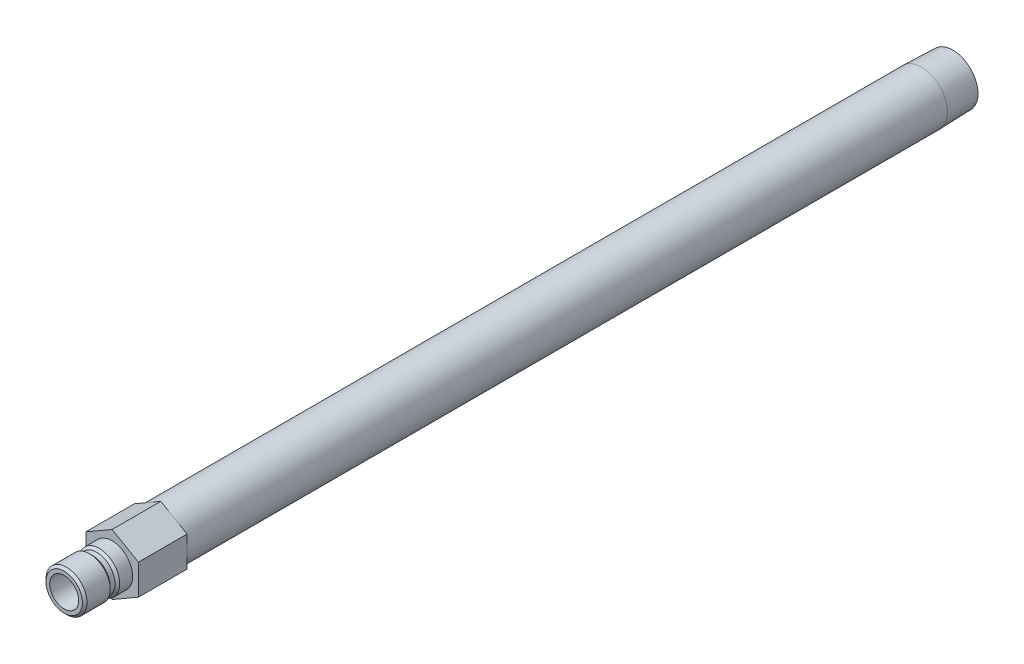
ISO-10303-21;
HEADER;
FILE_DESCRIPTION(('STEP AP214'),'2;1');
FILE_NAME('part.step','',(''),(''),'','','');
FILE_SCHEMA(('AUTOMOTIVE_DESIGN { 1 0 10303 214 1 1 1 1 }'));
ENDSEC;
DATA;
#1=APPLICATION_CONTEXT('core data for automotive mechanical design processes');
#2=APPLICATION_PROTOCOL_DEFINITION('international standard','automotive_design',2000,#1);
#3=PRODUCT_CONTEXT('',#1,'mechanical');
#4=PRODUCT('Part','Part','',(#3));
#5=PRODUCT_RELATED_PRODUCT_CATEGORY('part','',(#4));
#6=PRODUCT_DEFINITION_FORMATION('','',#4);
#7=PRODUCT_DEFINITION_CONTEXT('part definition',#1,'design');
#8=PRODUCT_DEFINITION('design','',#6,#7);
#9=PRODUCT_DEFINITION_SHAPE('','',#8);
#10=(LENGTH_UNIT() NAMED_UNIT(*) SI_UNIT(.MILLI.,.METRE.));
#11=(NAMED_UNIT(*) PLANE_ANGLE_UNIT() SI_UNIT($,.RADIAN.));
#12=(NAMED_UNIT(*) SI_UNIT($,.STERADIAN.) SOLID_ANGLE_UNIT());
#13=UNCERTAINTY_MEASURE_WITH_UNIT(LENGTH_MEASURE(1.E-05),#10,'distance_accuracy_value','');
#14=(GEOMETRIC_REPRESENTATION_CONTEXT(3) GLOBAL_UNCERTAINTY_ASSIGNED_CONTEXT((#13)) GLOBAL_UNIT_ASSIGNED_CONTEXT((#10,
#11,#12)) REPRESENTATION_CONTEXT('',''));
#15=CARTESIAN_POINT('',(0.,0.,0.));
#16=DIRECTION('',(0.,0.,1.));
#17=DIRECTION('',(1.,0.,0.));
#18=AXIS2_PLACEMENT_3D('',#15,#16,#17);
#19=CARTESIAN_POINT('',(0.,0.,0.));
#20=DIRECTION('',(0.,0.,-1.));
#21=DIRECTION('',(0.,1.,0.));
#22=AXIS2_PLACEMENT_3D('',#19,#20,#21);
#23=CYLINDRICAL_SURFACE('',#22,8.57249999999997);
#24=CARTESIAN_POINT('',(0.,0.,-266.0142));
#25=DIRECTION('',(0.,0.,-1.));
#26=DIRECTION('',(0.,1.,0.));
#27=AXIS2_PLACEMENT_3D('',#24,#25,#26);
#28=CIRCLE('',#27,8.57249999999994);
#29=CARTESIAN_POINT('',(0.,8.5725,-266.0142));
#30=VERTEX_POINT('',#29);
#31=EDGE_CURVE('E168',#30,#30,#28,.T.);
#32=ORIENTED_EDGE('',*,*,#31,.F.);
#33=EDGE_LOOP('',(#32));
#34=FACE_BOUND('',#33,.T.);
#35=CARTESIAN_POINT('',(0.,0.,-16.002));
#36=DIRECTION('',(0.,0.,1.));
#37=DIRECTION('',(1.,0.,0.));
#38=AXIS2_PLACEMENT_3D('',#35,#36,#37);
#39=CIRCLE('',#38,8.57249999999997);
#40=CARTESIAN_POINT('',(8.57249999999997,0.,-16.002));
#41=VERTEX_POINT('',#40);
#42=EDGE_CURVE('E37',#41,#41,#39,.F.);
#43=ORIENTED_EDGE('',*,*,#42,.T.);
#44=EDGE_LOOP('',(#43));
#45=FACE_BOUND('',#44,.T.);
#46=ADVANCED_FACE('F33',(#34,#45),#23,.T.);
#47=CARTESIAN_POINT('',(0.,0.,0.));
#48=DIRECTION('',(0.,0.,-1.));
#49=DIRECTION('',(0.,1.,0.));
#50=AXIS2_PLACEMENT_3D('',#47,#48,#49);
#51=CYLINDRICAL_SURFACE('',#50,4.7625);
#52=CARTESIAN_POINT('',(0.,0.,15.748));
#53=DIRECTION('',(0.,0.,-1.));
#54=DIRECTION('',(0.,1.,0.));
#55=AXIS2_PLACEMENT_3D('',#52,#53,#54);
#56=CIRCLE('',#55,4.7625);
#57=CARTESIAN_POINT('',(0.,4.7625,15.748));
#58=VERTEX_POINT('',#57);
#59=EDGE_CURVE('E144',#58,#58,#56,.T.);
#60=ORIENTED_EDGE('',*,*,#59,.F.);
#61=EDGE_LOOP('',(#60));
#62=FACE_BOUND('',#61,.T.);
#63=CARTESIAN_POINT('',(0.,0.,-16.002));
#64=DIRECTION('',(0.,0.,-1.));
#65=DIRECTION('',(0.,1.,0.));
#66=AXIS2_PLACEMENT_3D('',#63,#64,#65);
#67=CIRCLE('',#66,4.76249999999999);
#68=CARTESIAN_POINT('',(0.,4.7625,-16.002));
#69=VERTEX_POINT('',#68);
#70=EDGE_CURVE('E11',#69,#69,#67,.T.);
#71=ORIENTED_EDGE('',*,*,#70,.T.);
#72=EDGE_LOOP('',(#71));
#73=FACE_BOUND('',#72,.T.);
#74=ADVANCED_FACE('F35',(#62,#73),#51,.F.);
#75=CARTESIAN_POINT('',(0.,4.7625,-16.002));
#76=DIRECTION('',(0.,0.,-1.));
#77=DIRECTION('',(0.,1.,0.));
#78=AXIS2_PLACEMENT_3D('',#75,#76,#77);
#79=PLANE('',#78);
#80=CARTESIAN_POINT('',(0.,0.,-16.002));
#81=DIRECTION('',(0.,0.,-1.));
#82=DIRECTION('',(0.,1.,0.));
#83=AXIS2_PLACEMENT_3D('',#80,#81,#82);
#84=CIRCLE('',#83,6.26109999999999);
#85=CARTESIAN_POINT('',(0.,6.2611,-16.002));
#86=VERTEX_POINT('',#85);
#87=EDGE_CURVE('E43',#86,#86,#84,.T.);
#88=ORIENTED_EDGE('',*,*,#87,.T.);
#89=EDGE_LOOP('',(#88));
#90=FACE_BOUND('',#89,.T.);
#91=ORIENTED_EDGE('',*,*,#70,.F.);
#92=EDGE_LOOP('',(#91));
#93=FACE_BOUND('',#92,.T.);
#94=ADVANCED_FACE('F180',(#90,#93),#79,.T.);
#95=CARTESIAN_POINT('',(0.,0.,0.));
#96=DIRECTION('',(0.,0.,-1.));
#97=DIRECTION('',(0.,1.,0.));
#98=AXIS2_PLACEMENT_3D('',#95,#96,#97);
#99=CYLINDRICAL_SURFACE('',#98,6.26109999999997);
#100=CARTESIAN_POINT('',(0.,0.,-276.352));
#101=DIRECTION('',(0.,0.,-1.));
#102=DIRECTION('',(0.,1.,0.));
#103=AXIS2_PLACEMENT_3D('',#100,#101,#102);
#104=CIRCLE('',#103,6.26109999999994);
#105=CARTESIAN_POINT('',(0.,6.2611,-276.352));
#106=VERTEX_POINT('',#105);
#107=EDGE_CURVE('E174',#106,#106,#104,.T.);
#108=ORIENTED_EDGE('',*,*,#107,.T.);
#109=EDGE_LOOP('',(#108));
#110=FACE_BOUND('',#109,.T.);
#111=ORIENTED_EDGE('',*,*,#87,.F.);
#112=EDGE_LOOP('',(#111));
#113=FACE_BOUND('',#112,.T.);
#114=ADVANCED_FACE('F183',(#110,#113),#99,.F.);
#115=CARTESIAN_POINT('',(0.,8.24944566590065,-276.352));
#116=DIRECTION('',(0.,0.,-1.));
#117=DIRECTION('',(0.,1.,0.));
#118=AXIS2_PLACEMENT_3D('',#115,#116,#117);
#119=PLANE('',#118);
#120=CARTESIAN_POINT('',(0.,0.,-276.352));
#121=DIRECTION('',(0.,0.,-1.));
#122=DIRECTION('',(0.,1.,0.));
#123=AXIS2_PLACEMENT_3D('',#120,#121,#122);
#124=CIRCLE('',#123,8.24944566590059);
#125=CARTESIAN_POINT('',(0.,8.24944566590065,-276.352));
#126=VERTEX_POINT('',#125);
#127=EDGE_CURVE('E171',#126,#126,#124,.T.);
#128=ORIENTED_EDGE('',*,*,#127,.T.);
#129=EDGE_LOOP('',(#128));
#130=FACE_BOUND('',#129,.T.);
#131=ORIENTED_EDGE('',*,*,#107,.F.);
#132=EDGE_LOOP('',(#131));
#133=FACE_BOUND('',#132,.T.);
#134=ADVANCED_FACE('F185',(#130,#133),#119,.T.);
#135=CARTESIAN_POINT('',(0.,0.,-276.352));
#136=DIRECTION('',(0.,0.,1.));
#137=DIRECTION('',(0.,-1.,0.));
#138=AXIS2_PLACEMENT_3D('',#135,#136,#137);
#139=CONICAL_SURFACE('',#138,8.24944566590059,0.0312396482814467);
#140=ORIENTED_EDGE('',*,*,#31,.T.);
#141=EDGE_LOOP('',(#140));
#142=FACE_BOUND('',#141,.T.);
#143=ORIENTED_EDGE('',*,*,#127,.F.);
#144=EDGE_LOOP('',(#143));
#145=FACE_BOUND('',#144,.T.);
#146=ADVANCED_FACE('F192',(#142,#145),#139,.T.);
#147=CARTESIAN_POINT('',(0.,6.7437,0.));
#148=DIRECTION('',(0.,0.,1.));
#149=DIRECTION('',(0.,-1.,0.));
#150=AXIS2_PLACEMENT_3D('',#147,#148,#149);
#151=PLANE('',#150);
#152=CARTESIAN_POINT('',(0.,0.,0.));
#153=DIRECTION('',(0.,0.,-1.));
#154=DIRECTION('',(0.,1.,0.));
#155=AXIS2_PLACEMENT_3D('',#152,#153,#154);
#156=CIRCLE('',#155,6.7437);
#157=CARTESIAN_POINT('',(0.,6.7437,0.));
#158=VERTEX_POINT('',#157);
#159=EDGE_CURVE('E165',#158,#158,#156,.T.);
#160=ORIENTED_EDGE('',*,*,#159,.T.);
#161=EDGE_LOOP('',(#160));
#162=FACE_BOUND('',#161,.T.);
#163=DIRECTION('',(-0.866025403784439,-0.5,0.));
#164=VECTOR('',#163,1.);
#165=CARTESIAN_POINT('',(0.,9.97199384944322,0.));
#166=LINE('',#165,#164);
#167=CARTESIAN_POINT('',(0.,9.97199384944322,0.));
#168=VERTEX_POINT('',#167);
#169=CARTESIAN_POINT('',(-8.636,4.98599692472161,0.));
#170=VERTEX_POINT('',#169);
#171=EDGE_CURVE('E122',#168,#170,#166,.T.);
#172=ORIENTED_EDGE('',*,*,#171,.T.);
#173=DIRECTION('',(0.,-1.,0.));
#174=VECTOR('',#173,1.);
#175=CARTESIAN_POINT('',(-8.636,4.98599692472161,0.));
#176=LINE('',#175,#174);
#177=CARTESIAN_POINT('',(-8.636,-4.98599692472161,0.));
#178=VERTEX_POINT('',#177);
#179=EDGE_CURVE('E125',#170,#178,#176,.T.);
#180=ORIENTED_EDGE('',*,*,#179,.T.);
#181=DIRECTION('',(0.866025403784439,-0.5,0.));
#182=VECTOR('',#181,1.);
#183=CARTESIAN_POINT('',(-8.636,-4.98599692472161,0.));
#184=LINE('',#183,#182);
#185=CARTESIAN_POINT('',(0.,-9.97199384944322,0.));
#186=VERTEX_POINT('',#185);
#187=EDGE_CURVE('E128',#178,#186,#184,.T.);
#188=ORIENTED_EDGE('',*,*,#187,.T.);
#189=DIRECTION('',(0.866025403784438,0.5,0.));
#190=VECTOR('',#189,1.);
#191=CARTESIAN_POINT('',(0.,-9.97199384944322,0.));
#192=LINE('',#191,#190);
#193=CARTESIAN_POINT('',(8.63599999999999,-4.98599692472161,0.));
#194=VERTEX_POINT('',#193);
#195=EDGE_CURVE('E131',#186,#194,#192,.T.);
#196=ORIENTED_EDGE('',*,*,#195,.T.);
#197=DIRECTION('',(0.,1.,0.));
#198=VECTOR('',#197,1.);
#199=CARTESIAN_POINT('',(8.63599999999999,-4.98599692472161,0.));
#200=LINE('',#199,#198);
#201=CARTESIAN_POINT('',(8.636,4.98599692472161,0.));
#202=VERTEX_POINT('',#201);
#203=EDGE_CURVE('E99',#194,#202,#200,.T.);
#204=ORIENTED_EDGE('',*,*,#203,.T.);
#205=DIRECTION('',(-0.866025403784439,0.5,0.));
#206=VECTOR('',#205,1.);
#207=CARTESIAN_POINT('',(8.636,4.98599692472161,0.));
#208=LINE('',#207,#206);
#209=EDGE_CURVE('E134',#202,#168,#208,.T.);
#210=ORIENTED_EDGE('',*,*,#209,.T.);
#211=EDGE_LOOP('',(#172,#180,#188,#196,#204,#210));
#212=FACE_BOUND('',#211,.T.);
#213=ADVANCED_FACE('F206',(#162,#212),#151,.T.);
#214=CARTESIAN_POINT('',(0.,0.,0.));
#215=DIRECTION('',(0.,0.,-1.));
#216=DIRECTION('',(0.,1.,0.));
#217=AXIS2_PLACEMENT_3D('',#214,#215,#216);
#218=CYLINDRICAL_SURFACE('',#217,6.7437);
#219=CARTESIAN_POINT('',(0.,0.,4.25449999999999));
#220=DIRECTION('',(0.,0.,-1.));
#221=DIRECTION('',(0.,1.,0.));
#222=AXIS2_PLACEMENT_3D('',#219,#220,#221);
#223=CIRCLE('',#222,6.7437);
#224=CARTESIAN_POINT('',(0.,6.7437,4.2545));
#225=VERTEX_POINT('',#224);
#226=EDGE_CURVE('E162',#225,#225,#223,.T.);
#227=ORIENTED_EDGE('',*,*,#226,.T.);
#228=EDGE_LOOP('',(#227));
#229=FACE_BOUND('',#228,.T.);
#230=ORIENTED_EDGE('',*,*,#159,.F.);
#231=EDGE_LOOP('',(#230));
#232=FACE_BOUND('',#231,.T.);
#233=ADVANCED_FACE('F213',(#229,#232),#218,.T.);
#234=CARTESIAN_POINT('',(0.,0.,4.25449999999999));
#235=DIRECTION('',(0.,0.,-1.));
#236=DIRECTION('',(0.,1.,0.));
#237=AXIS2_PLACEMENT_3D('',#234,#235,#236);
#238=CONICAL_SURFACE('',#237,6.7437,0.785398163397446);
#239=CARTESIAN_POINT('',(0.,0.,5.0165));
#240=DIRECTION('',(0.,0.,-1.));
#241=DIRECTION('',(0.,1.,0.));
#242=AXIS2_PLACEMENT_3D('',#239,#240,#241);
#243=CIRCLE('',#242,5.9817);
#244=CARTESIAN_POINT('',(0.,5.9817,5.0165));
#245=VERTEX_POINT('',#244);
#246=EDGE_CURVE('E159',#245,#245,#243,.T.);
#247=ORIENTED_EDGE('',*,*,#246,.T.);
#248=EDGE_LOOP('',(#247));
#249=FACE_BOUND('',#248,.T.);
#250=ORIENTED_EDGE('',*,*,#226,.F.);
#251=EDGE_LOOP('',(#250));
#252=FACE_BOUND('',#251,.T.);
#253=ADVANCED_FACE('F222',(#249,#252),#238,.T.);
#254=CARTESIAN_POINT('',(0.,0.,0.));
#255=DIRECTION('',(0.,0.,-1.));
#256=DIRECTION('',(0.,1.,0.));
#257=AXIS2_PLACEMENT_3D('',#254,#255,#256);
#258=CYLINDRICAL_SURFACE('',#257,5.9817);
#259=CARTESIAN_POINT('',(0.,0.,6.604));
#260=DIRECTION('',(0.,0.,-1.));
#261=DIRECTION('',(0.,1.,0.));
#262=AXIS2_PLACEMENT_3D('',#259,#260,#261);
#263=CIRCLE('',#262,5.9817);
#264=CARTESIAN_POINT('',(0.,5.9817,6.604));
#265=VERTEX_POINT('',#264);
#266=EDGE_CURVE('E156',#265,#265,#263,.T.);
#267=ORIENTED_EDGE('',*,*,#266,.T.);
#268=EDGE_LOOP('',(#267));
#269=FACE_BOUND('',#268,.T.);
#270=ORIENTED_EDGE('',*,*,#246,.F.);
#271=EDGE_LOOP('',(#270));
#272=FACE_BOUND('',#271,.T.);
#273=ADVANCED_FACE('F263',(#269,#272),#258,.T.);
#274=CARTESIAN_POINT('',(0.,0.,6.604));
#275=DIRECTION('',(0.,0.,1.));
#276=DIRECTION('',(0.,-1.,0.));
#277=AXIS2_PLACEMENT_3D('',#274,#275,#276);
#278=CONICAL_SURFACE('',#277,5.9817,0.785398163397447);
#279=CARTESIAN_POINT('',(0.,0.,7.366));
#280=DIRECTION('',(0.,0.,-1.));
#281=DIRECTION('',(0.,1.,0.));
#282=AXIS2_PLACEMENT_3D('',#279,#280,#281);
#283=CIRCLE('',#282,6.7437);
#284=CARTESIAN_POINT('',(0.,6.7437,7.366));
#285=VERTEX_POINT('',#284);
#286=EDGE_CURVE('E153',#285,#285,#283,.T.);
#287=ORIENTED_EDGE('',*,*,#286,.T.);
#288=EDGE_LOOP('',(#287));
#289=FACE_BOUND('',#288,.T.);
#290=ORIENTED_EDGE('',*,*,#266,.F.);
#291=EDGE_LOOP('',(#290));
#292=FACE_BOUND('',#291,.T.);
#293=ADVANCED_FACE('F259',(#289,#292),#278,.T.);
#294=CARTESIAN_POINT('',(0.,0.,0.));
#295=DIRECTION('',(0.,0.,-1.));
#296=DIRECTION('',(0.,1.,0.));
#297=AXIS2_PLACEMENT_3D('',#294,#295,#296);
#298=CYLINDRICAL_SURFACE('',#297,6.7437);
#299=CARTESIAN_POINT('',(0.,0.,14.986));
#300=DIRECTION('',(0.,0.,-1.));
#301=DIRECTION('',(0.,1.,0.));
#302=AXIS2_PLACEMENT_3D('',#299,#300,#301);
#303=CIRCLE('',#302,6.7437);
#304=CARTESIAN_POINT('',(0.,6.7437,14.986));
#305=VERTEX_POINT('',#304);
#306=EDGE_CURVE('E150',#305,#305,#303,.T.);
#307=ORIENTED_EDGE('',*,*,#306,.T.);
#308=EDGE_LOOP('',(#307));
#309=FACE_BOUND('',#308,.T.);
#310=ORIENTED_EDGE('',*,*,#286,.F.);
#311=EDGE_LOOP('',(#310));
#312=FACE_BOUND('',#311,.T.);
#313=ADVANCED_FACE('F255',(#309,#312),#298,.T.);
#314=CARTESIAN_POINT('',(0.,0.,14.986));
#315=DIRECTION('',(0.,0.,-1.));
#316=DIRECTION('',(0.,1.,0.));
#317=AXIS2_PLACEMENT_3D('',#314,#315,#316);
#318=CONICAL_SURFACE('',#317,6.7437,0.785398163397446);
#319=CARTESIAN_POINT('',(0.,0.,15.748));
#320=DIRECTION('',(0.,0.,-1.));
#321=DIRECTION('',(0.,1.,0.));
#322=AXIS2_PLACEMENT_3D('',#319,#320,#321);
#323=CIRCLE('',#322,5.9817);
#324=CARTESIAN_POINT('',(0.,5.9817,15.748));
#325=VERTEX_POINT('',#324);
#326=EDGE_CURVE('E147',#325,#325,#323,.T.);
#327=ORIENTED_EDGE('',*,*,#326,.T.);
#328=EDGE_LOOP('',(#327));
#329=FACE_BOUND('',#328,.T.);
#330=ORIENTED_EDGE('',*,*,#306,.F.);
#331=EDGE_LOOP('',(#330));
#332=FACE_BOUND('',#331,.T.);
#333=ADVANCED_FACE('F251',(#329,#332),#318,.T.);
#334=CARTESIAN_POINT('',(0.,4.7625,15.748));
#335=DIRECTION('',(0.,0.,1.));
#336=DIRECTION('',(0.,-1.,0.));
#337=AXIS2_PLACEMENT_3D('',#334,#335,#336);
#338=PLANE('',#337);
#339=ORIENTED_EDGE('',*,*,#59,.T.);
#340=EDGE_LOOP('',(#339));
#341=FACE_BOUND('',#340,.T.);
#342=ORIENTED_EDGE('',*,*,#326,.F.);
#343=EDGE_LOOP('',(#342));
#344=FACE_BOUND('',#343,.T.);
#345=ADVANCED_FACE('F239',(#341,#344),#338,.T.);
#346=CARTESIAN_POINT('',(0.,9.97199384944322,-16.002));
#347=DIRECTION('',(-0.5,0.866025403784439,0.));
#348=DIRECTION('',(-0.866025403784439,-0.5,0.));
#349=AXIS2_PLACEMENT_3D('',#346,#347,#348);
#350=PLANE('',#349);
#351=ORIENTED_EDGE('',*,*,#171,.F.);
#352=DIRECTION('',(0.,0.,1.));
#353=VECTOR('',#352,1.);
#354=CARTESIAN_POINT('',(0.,9.97199384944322,-16.002));
#355=LINE('',#354,#353);
#356=CARTESIAN_POINT('',(0.,9.97199384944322,-16.002));
#357=VERTEX_POINT('',#356);
#358=EDGE_CURVE('E51',#357,#168,#355,.T.);
#359=ORIENTED_EDGE('',*,*,#358,.F.);
#360=DIRECTION('',(-0.866025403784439,-0.5,0.));
#361=VECTOR('',#360,1.);
#362=CARTESIAN_POINT('',(0.,9.97199384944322,-16.002));
#363=LINE('',#362,#361);
#364=CARTESIAN_POINT('',(-8.636,4.98599692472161,-16.002));
#365=VERTEX_POINT('',#364);
#366=EDGE_CURVE('E137',#357,#365,#363,.T.);
#367=ORIENTED_EDGE('',*,*,#366,.T.);
#368=DIRECTION('',(0.,0.,1.));
#369=VECTOR('',#368,1.);
#370=CARTESIAN_POINT('',(-8.636,4.98599692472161,-16.002));
#371=LINE('',#370,#369);
#372=EDGE_CURVE('E86',#365,#170,#371,.T.);
#373=ORIENTED_EDGE('',*,*,#372,.T.);
#374=EDGE_LOOP('',(#351,#359,#367,#373));
#375=FACE_BOUND('',#374,.T.);
#376=ADVANCED_FACE('F226',(#375),#350,.T.);
#377=CARTESIAN_POINT('',(8.636,4.98599692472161,-16.002));
#378=DIRECTION('',(0.5,0.866025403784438,0.));
#379=DIRECTION('',(-0.866025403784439,0.5,0.));
#380=AXIS2_PLACEMENT_3D('',#377,#378,#379);
#381=PLANE('',#380);
#382=ORIENTED_EDGE('',*,*,#209,.F.);
#383=DIRECTION('',(0.,0.,1.));
#384=VECTOR('',#383,1.);
#385=CARTESIAN_POINT('',(8.636,4.98599692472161,-16.002));
#386=LINE('',#385,#384);
#387=CARTESIAN_POINT('',(8.636,4.98599692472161,-16.002));
#388=VERTEX_POINT('',#387);
#389=EDGE_CURVE('E74',#388,#202,#386,.T.);
#390=ORIENTED_EDGE('',*,*,#389,.F.);
#391=DIRECTION('',(-0.866025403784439,0.5,0.));
#392=VECTOR('',#391,1.);
#393=CARTESIAN_POINT('',(8.636,4.98599692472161,-16.002));
#394=LINE('',#393,#392);
#395=EDGE_CURVE('E112',#388,#357,#394,.T.);
#396=ORIENTED_EDGE('',*,*,#395,.T.);
#397=ORIENTED_EDGE('',*,*,#358,.T.);
#398=EDGE_LOOP('',(#382,#390,#396,#397));
#399=FACE_BOUND('',#398,.T.);
#400=ADVANCED_FACE('F231',(#399),#381,.T.);
#401=CARTESIAN_POINT('',(8.63599999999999,-4.98599692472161,-16.002));
#402=DIRECTION('',(1.,0.,0.));
#403=DIRECTION('',(0.,1.,0.));
#404=AXIS2_PLACEMENT_3D('',#401,#402,#403);
#405=PLANE('',#404);
#406=ORIENTED_EDGE('',*,*,#203,.F.);
#407=DIRECTION('',(0.,0.,1.));
#408=VECTOR('',#407,1.);
#409=CARTESIAN_POINT('',(8.63599999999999,-4.98599692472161,-16.002));
#410=LINE('',#409,#408);
#411=CARTESIAN_POINT('',(8.63599999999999,-4.98599692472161,-16.002));
#412=VERTEX_POINT('',#411);
#413=EDGE_CURVE('E94',#412,#194,#410,.T.);
#414=ORIENTED_EDGE('',*,*,#413,.F.);
#415=DIRECTION('',(0.,1.,0.));
#416=VECTOR('',#415,1.);
#417=CARTESIAN_POINT('',(8.63599999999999,-4.98599692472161,-16.002));
#418=LINE('',#417,#416);
#419=EDGE_CURVE('E97',#412,#388,#418,.T.);
#420=ORIENTED_EDGE('',*,*,#419,.T.);
#421=ORIENTED_EDGE('',*,*,#389,.T.);
#422=EDGE_LOOP('',(#406,#414,#420,#421));
#423=FACE_BOUND('',#422,.T.);
#424=ADVANCED_FACE('F96',(#423),#405,.T.);
#425=CARTESIAN_POINT('',(0.,-9.97199384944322,-16.002));
#426=DIRECTION('',(0.5,-0.866025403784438,0.));
#427=DIRECTION('',(0.866025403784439,0.5,0.));
#428=AXIS2_PLACEMENT_3D('',#425,#426,#427);
#429=PLANE('',#428);
#430=ORIENTED_EDGE('',*,*,#195,.F.);
#431=DIRECTION('',(0.,0.,1.));
#432=VECTOR('',#431,1.);
#433=CARTESIAN_POINT('',(0.,-9.97199384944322,-16.002));
#434=LINE('',#433,#432);
#435=CARTESIAN_POINT('',(0.,-9.97199384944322,-16.002));
#436=VERTEX_POINT('',#435);
#437=EDGE_CURVE('E104',#436,#186,#434,.T.);
#438=ORIENTED_EDGE('',*,*,#437,.F.);
#439=DIRECTION('',(0.866025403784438,0.5,0.));
#440=VECTOR('',#439,1.);
#441=CARTESIAN_POINT('',(0.,-9.97199384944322,-16.002));
#442=LINE('',#441,#440);
#443=EDGE_CURVE('E110',#436,#412,#442,.T.);
#444=ORIENTED_EDGE('',*,*,#443,.T.);
#445=ORIENTED_EDGE('',*,*,#413,.T.);
#446=EDGE_LOOP('',(#430,#438,#444,#445));
#447=FACE_BOUND('',#446,.T.);
#448=ADVANCED_FACE('F114',(#447),#429,.T.);
#449=CARTESIAN_POINT('',(-8.636,-4.98599692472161,-16.002));
#450=DIRECTION('',(-0.5,-0.866025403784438,0.));
#451=DIRECTION('',(0.866025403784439,-0.5,0.));
#452=AXIS2_PLACEMENT_3D('',#449,#450,#451);
#453=PLANE('',#452);
#454=ORIENTED_EDGE('',*,*,#187,.F.);
#455=DIRECTION('',(0.,0.,1.));
#456=VECTOR('',#455,1.);
#457=CARTESIAN_POINT('',(-8.636,-4.98599692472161,-16.002));
#458=LINE('',#457,#456);
#459=CARTESIAN_POINT('',(-8.636,-4.98599692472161,-16.002));
#460=VERTEX_POINT('',#459);
#461=EDGE_CURVE('E141',#460,#178,#458,.T.);
#462=ORIENTED_EDGE('',*,*,#461,.F.);
#463=DIRECTION('',(0.866025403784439,-0.5,0.));
#464=VECTOR('',#463,1.);
#465=CARTESIAN_POINT('',(-8.636,-4.98599692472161,-16.002));
#466=LINE('',#465,#464);
#467=EDGE_CURVE('E115',#460,#436,#466,.T.);
#468=ORIENTED_EDGE('',*,*,#467,.T.);
#469=ORIENTED_EDGE('',*,*,#437,.T.);
#470=EDGE_LOOP('',(#454,#462,#468,#469));
#471=FACE_BOUND('',#470,.T.);
#472=ADVANCED_FACE('F230',(#471),#453,.T.);
#473=CARTESIAN_POINT('',(-8.636,4.98599692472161,-16.002));
#474=DIRECTION('',(-1.,0.,0.));
#475=DIRECTION('',(0.,0.,1.));
#476=AXIS2_PLACEMENT_3D('',#473,#474,#475);
#477=PLANE('',#476);
#478=ORIENTED_EDGE('',*,*,#179,.F.);
#479=ORIENTED_EDGE('',*,*,#372,.F.);
#480=DIRECTION('',(0.,-1.,0.));
#481=VECTOR('',#480,1.);
#482=CARTESIAN_POINT('',(-8.636,4.98599692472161,-16.002));
#483=LINE('',#482,#481);
#484=EDGE_CURVE('E117',#365,#460,#483,.T.);
#485=ORIENTED_EDGE('',*,*,#484,.T.);
#486=ORIENTED_EDGE('',*,*,#461,.T.);
#487=EDGE_LOOP('',(#478,#479,#485,#486));
#488=FACE_BOUND('',#487,.T.);
#489=ADVANCED_FACE('F227',(#488),#477,.T.);
#490=CARTESIAN_POINT('',(-8.636,4.98599692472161,-16.002));
#491=DIRECTION('',(0.,0.,1.));
#492=DIRECTION('',(1.,0.,0.));
#493=AXIS2_PLACEMENT_3D('',#490,#491,#492);
#494=PLANE('',#493);
#495=ORIENTED_EDGE('',*,*,#42,.F.);
#496=EDGE_LOOP('',(#495));
#497=FACE_BOUND('',#496,.T.);
#498=ORIENTED_EDGE('',*,*,#366,.F.);
#499=ORIENTED_EDGE('',*,*,#395,.F.);
#500=ORIENTED_EDGE('',*,*,#419,.F.);
#501=ORIENTED_EDGE('',*,*,#443,.F.);
#502=ORIENTED_EDGE('',*,*,#467,.F.);
#503=ORIENTED_EDGE('',*,*,#484,.F.);
#504=EDGE_LOOP('',(#498,#499,#500,#501,#502,#503));
#505=FACE_BOUND('',#504,.T.);
#506=ADVANCED_FACE('F108',(#497,#505),#494,.F.);
#507=CLOSED_SHELL('',(#46,#74,#94,#114,#134,#146,#213,#233,#253,#273,#293,#313,#333,#345,#376,
#400,#424,#448,#472,#489,#506));
#508=MANIFOLD_SOLID_BREP('B2',#507);
#509=ADVANCED_BREP_SHAPE_REPRESENTATION('',(#18,#508),#14);
#510=SHAPE_DEFINITION_REPRESENTATION(#9,#509);
ENDSEC;
END-ISO-10303-21;
